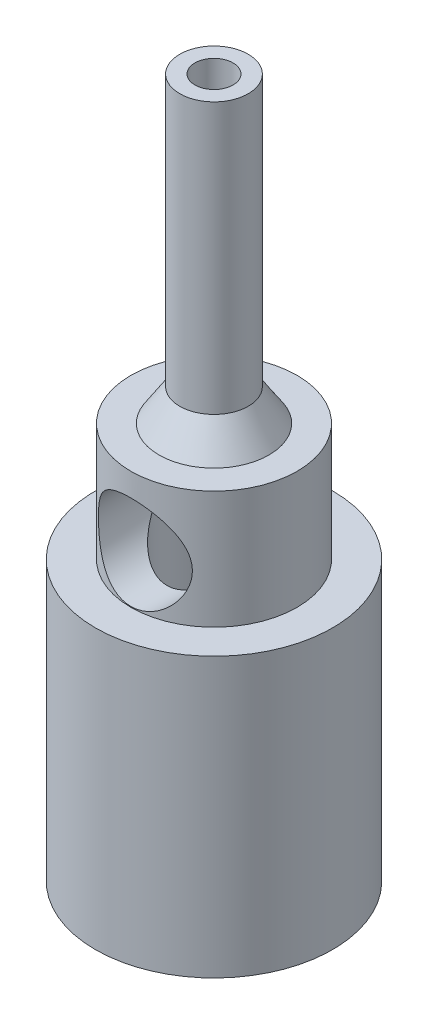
from build123d import *

# Parameters (mm, degrees)
ESQUISSE2_R             = 2.95
ENL_V_MAT_EXTRU_1_DEPTH = 10
ESQUISSE3_W             = 0.95
ESQUISSE3_H             = 0.970003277
ESQUISSE4_W             = 1.254845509
ESQUISSE4_H             = 0.392620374


with BuildPart() as part:
    # Esquisse1 → R_volution1 (revolve)
    with BuildSketch(Plane.XY, mode=Mode.PRIVATE) as r_volution1_sk:
        Polygon((1.2, 22.5), (1.2, 43.9), (2.15, 43.9), (2.15, 26.9), (3.45, 24.9), (5.22, 24.9), (5.22, 17.5), (7.45, 17.5), (7.45, 0), (6.1, 0), (6.1, 0.7), (4.15, 0.7), (3.45, 0), (2.95, 0), (2.95, 23.5), (2.15, 23.5), (2.15, 22.5), align=None)
    revolve(r_volution1_sk.sketch.rotate(Axis((0, 37.953602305, 0), (0, -1, 0)), 90), axis=Axis((0, 37.953602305, 0), (0, -1, 0)))

    # Esquisse2 → Enl_v. mat.-Extru.1 (cut, symmetric)
    with BuildSketch(Plane.XY):
        with Locations((0, 20.5)):
            Circle(ESQUISSE2_R)
    extrude(amount=ENL_V_MAT_EXTRU_1_DEPTH, both=True, mode=Mode.SUBTRACT)

    # Esquisse3 → R_volution2 (revolve)
    with BuildSketch(Plane.XY, mode=Mode.PRIVATE) as r_volution2_sk:
        with Locations((1.675, 23.321614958)):
            Rectangle(ESQUISSE3_W, ESQUISSE3_H)
    revolve(r_volution2_sk.sketch.rotate(Axis((0, 23.45, 0), (0, -1, 0)), 90), axis=Axis((0, 23.45, 0), (0, -1, 0)))

    # Esquisse4 → Enl_vement de mati_re-R_volution1 (revolve, cut)
    with BuildSketch(Plane.XY, mode=Mode.PRIVATE) as enl_vement_de_mati_re_r_volution1_sk:
        with Locations((1.68974853, 22.640303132)):
            Rectangle(ESQUISSE4_W, ESQUISSE4_H)
    revolve(enl_vement_de_mati_re_r_volution1_sk.sketch.rotate(Axis((0, 22.836613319, 0), (0, 1, 0)), 270), axis=Axis((0, 22.836613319, 0), (0, 1, 0)), mode=Mode.SUBTRACT)


solid = part.part
